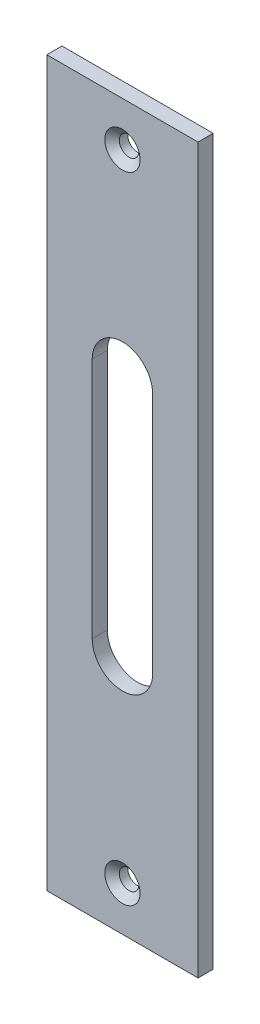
ISO-10303-21;
HEADER;
FILE_DESCRIPTION(('STEP AP214'),'2;1');
FILE_NAME('part.step','',(''),(''),'','','');
FILE_SCHEMA(('AUTOMOTIVE_DESIGN { 1 0 10303 214 1 1 1 1 }'));
ENDSEC;
DATA;
#1=APPLICATION_CONTEXT('core data for automotive mechanical design processes');
#2=APPLICATION_PROTOCOL_DEFINITION('international standard','automotive_design',2000,#1);
#3=PRODUCT_CONTEXT('',#1,'mechanical');
#4=PRODUCT('Part','Part','',(#3));
#5=PRODUCT_RELATED_PRODUCT_CATEGORY('part','',(#4));
#6=PRODUCT_DEFINITION_FORMATION('','',#4);
#7=PRODUCT_DEFINITION_CONTEXT('part definition',#1,'design');
#8=PRODUCT_DEFINITION('design','',#6,#7);
#9=PRODUCT_DEFINITION_SHAPE('','',#8);
#10=(LENGTH_UNIT() NAMED_UNIT(*) SI_UNIT(.MILLI.,.METRE.));
#11=(NAMED_UNIT(*) PLANE_ANGLE_UNIT() SI_UNIT($,.RADIAN.));
#12=(NAMED_UNIT(*) SI_UNIT($,.STERADIAN.) SOLID_ANGLE_UNIT());
#13=UNCERTAINTY_MEASURE_WITH_UNIT(LENGTH_MEASURE(1.E-05),#10,'distance_accuracy_value','');
#14=(GEOMETRIC_REPRESENTATION_CONTEXT(3) GLOBAL_UNCERTAINTY_ASSIGNED_CONTEXT((#13)) GLOBAL_UNIT_ASSIGNED_CONTEXT((#10,
#11,#12)) REPRESENTATION_CONTEXT('',''));
#15=CARTESIAN_POINT('',(0.,0.,0.));
#16=DIRECTION('',(0.,0.,1.));
#17=DIRECTION('',(1.,0.,0.));
#18=AXIS2_PLACEMENT_3D('',#15,#16,#17);
#19=CARTESIAN_POINT('',(-7.9375,-38.,1.5875));
#20=DIRECTION('',(1.,0.,0.));
#21=DIRECTION('',(0.,0.,-1.));
#22=AXIS2_PLACEMENT_3D('',#19,#20,#21);
#23=PLANE('',#22);
#24=DIRECTION('',(0.,-1.,0.));
#25=VECTOR('',#24,1.);
#26=CARTESIAN_POINT('',(-7.9375,-38.,0.));
#27=LINE('',#26,#25);
#28=CARTESIAN_POINT('',(-7.9375,38.,0.));
#29=VERTEX_POINT('',#28);
#30=CARTESIAN_POINT('',(-7.9375,-38.,0.));
#31=VERTEX_POINT('',#30);
#32=EDGE_CURVE('E133',#29,#31,#27,.T.);
#33=ORIENTED_EDGE('',*,*,#32,.T.);
#34=DIRECTION('',(0.,0.,-1.));
#35=VECTOR('',#34,1.);
#36=CARTESIAN_POINT('',(-7.9375,-38.,1.5875));
#37=LINE('',#36,#35);
#38=CARTESIAN_POINT('',(-7.9375,-38.,1.5875));
#39=VERTEX_POINT('',#38);
#40=EDGE_CURVE('E11',#39,#31,#37,.T.);
#41=ORIENTED_EDGE('',*,*,#40,.F.);
#42=DIRECTION('',(0.,-1.,0.));
#43=VECTOR('',#42,1.);
#44=CARTESIAN_POINT('',(-7.9375,-38.,1.5875));
#45=LINE('',#44,#43);
#46=CARTESIAN_POINT('',(-7.9375,38.,1.5875));
#47=VERTEX_POINT('',#46);
#48=EDGE_CURVE('E144',#47,#39,#45,.T.);
#49=ORIENTED_EDGE('',*,*,#48,.F.);
#50=DIRECTION('',(0.,0.,-1.));
#51=VECTOR('',#50,1.);
#52=CARTESIAN_POINT('',(-7.9375,38.,1.5875));
#53=LINE('',#52,#51);
#54=EDGE_CURVE('E153',#47,#29,#53,.T.);
#55=ORIENTED_EDGE('',*,*,#54,.T.);
#56=EDGE_LOOP('',(#33,#41,#49,#55));
#57=FACE_BOUND('',#56,.T.);
#58=ADVANCED_FACE('F33',(#57),#23,.F.);
#59=CARTESIAN_POINT('',(-7.9375,-38.,1.5875));
#60=DIRECTION('',(0.,1.,0.));
#61=DIRECTION('',(0.,0.,1.));
#62=AXIS2_PLACEMENT_3D('',#59,#60,#61);
#63=PLANE('',#62);
#64=DIRECTION('',(1.,0.,0.));
#65=VECTOR('',#64,1.);
#66=CARTESIAN_POINT('',(-7.9375,-38.,0.));
#67=LINE('',#66,#65);
#68=CARTESIAN_POINT('',(7.93749999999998,-38.,0.));
#69=VERTEX_POINT('',#68);
#70=EDGE_CURVE('E138',#31,#69,#67,.T.);
#71=ORIENTED_EDGE('',*,*,#70,.T.);
#72=DIRECTION('',(0.,0.,-1.));
#73=VECTOR('',#72,1.);
#74=CARTESIAN_POINT('',(7.93749999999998,-38.,1.5875));
#75=LINE('',#74,#73);
#76=CARTESIAN_POINT('',(7.93749999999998,-38.,1.5875));
#77=VERTEX_POINT('',#76);
#78=EDGE_CURVE('E41',#77,#69,#75,.T.);
#79=ORIENTED_EDGE('',*,*,#78,.F.);
#80=DIRECTION('',(1.,0.,0.));
#81=VECTOR('',#80,1.);
#82=CARTESIAN_POINT('',(-7.9375,-38.,1.5875));
#83=LINE('',#82,#81);
#84=EDGE_CURVE('E147',#39,#77,#83,.T.);
#85=ORIENTED_EDGE('',*,*,#84,.F.);
#86=ORIENTED_EDGE('',*,*,#40,.T.);
#87=EDGE_LOOP('',(#71,#79,#85,#86));
#88=FACE_BOUND('',#87,.T.);
#89=ADVANCED_FACE('F205',(#88),#63,.F.);
#90=CARTESIAN_POINT('',(7.93749999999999,38.,1.5875));
#91=DIRECTION('',(-1.,0.,0.));
#92=DIRECTION('',(0.,-1.,0.));
#93=AXIS2_PLACEMENT_3D('',#90,#91,#92);
#94=PLANE('',#93);
#95=DIRECTION('',(0.,1.,0.));
#96=VECTOR('',#95,1.);
#97=CARTESIAN_POINT('',(7.93749999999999,38.,0.));
#98=LINE('',#97,#96);
#99=CARTESIAN_POINT('',(7.93749999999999,38.,0.));
#100=VERTEX_POINT('',#99);
#101=EDGE_CURVE('E140',#69,#100,#98,.T.);
#102=ORIENTED_EDGE('',*,*,#101,.T.);
#103=DIRECTION('',(0.,0.,-1.));
#104=VECTOR('',#103,1.);
#105=CARTESIAN_POINT('',(7.93749999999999,38.,1.5875));
#106=LINE('',#105,#104);
#107=CARTESIAN_POINT('',(7.93749999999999,38.,1.5875));
#108=VERTEX_POINT('',#107);
#109=EDGE_CURVE('E156',#108,#100,#106,.T.);
#110=ORIENTED_EDGE('',*,*,#109,.F.);
#111=DIRECTION('',(0.,1.,0.));
#112=VECTOR('',#111,1.);
#113=CARTESIAN_POINT('',(7.93749999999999,38.,1.5875));
#114=LINE('',#113,#112);
#115=EDGE_CURVE('E149',#77,#108,#114,.T.);
#116=ORIENTED_EDGE('',*,*,#115,.F.);
#117=ORIENTED_EDGE('',*,*,#78,.T.);
#118=EDGE_LOOP('',(#102,#110,#116,#117));
#119=FACE_BOUND('',#118,.T.);
#120=ADVANCED_FACE('F201',(#119),#94,.F.);
#121=CARTESIAN_POINT('',(7.93749999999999,38.,1.5875));
#122=DIRECTION('',(0.,-1.,0.));
#123=DIRECTION('',(0.,0.,-1.));
#124=AXIS2_PLACEMENT_3D('',#121,#122,#123);
#125=PLANE('',#124);
#126=DIRECTION('',(-1.,0.,0.));
#127=VECTOR('',#126,1.);
#128=CARTESIAN_POINT('',(7.93749999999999,38.,0.));
#129=LINE('',#128,#127);
#130=EDGE_CURVE('E142',#100,#29,#129,.T.);
#131=ORIENTED_EDGE('',*,*,#130,.T.);
#132=ORIENTED_EDGE('',*,*,#54,.F.);
#133=DIRECTION('',(-1.,0.,0.));
#134=VECTOR('',#133,1.);
#135=CARTESIAN_POINT('',(7.93749999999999,38.,1.5875));
#136=LINE('',#135,#134);
#137=EDGE_CURVE('E151',#108,#47,#136,.T.);
#138=ORIENTED_EDGE('',*,*,#137,.F.);
#139=ORIENTED_EDGE('',*,*,#109,.T.);
#140=EDGE_LOOP('',(#131,#132,#138,#139));
#141=FACE_BOUND('',#140,.T.);
#142=ADVANCED_FACE('F192',(#141),#125,.F.);
#143=CARTESIAN_POINT('',(-7.9375,38.,1.5875));
#144=DIRECTION('',(0.,0.,1.));
#145=DIRECTION('',(1.,0.,0.));
#146=AXIS2_PLACEMENT_3D('',#143,#144,#145);
#147=PLANE('',#146);
#148=CARTESIAN_POINT('',(0.,33.3375,1.5875));
#149=DIRECTION('',(0.,0.,1.));
#150=DIRECTION('',(1.,0.,0.));
#151=AXIS2_PLACEMENT_3D('',#148,#149,#150);
#152=CIRCLE('',#151,1.8542);
#153=CARTESIAN_POINT('',(1.85420000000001,33.3375,1.5875));
#154=VERTEX_POINT('',#153);
#155=EDGE_CURVE('E173',#154,#154,#152,.T.);
#156=ORIENTED_EDGE('',*,*,#155,.F.);
#157=EDGE_LOOP('',(#156));
#158=FACE_BOUND('',#157,.T.);
#159=CARTESIAN_POINT('',(0.,-33.3375,1.5875));
#160=DIRECTION('',(0.,0.,1.));
#161=DIRECTION('',(1.,0.,0.));
#162=AXIS2_PLACEMENT_3D('',#159,#160,#161);
#163=CIRCLE('',#162,1.8542);
#164=CARTESIAN_POINT('',(1.8542,-33.3375,1.5875));
#165=VERTEX_POINT('',#164);
#166=EDGE_CURVE('E162',#165,#165,#163,.T.);
#167=ORIENTED_EDGE('',*,*,#166,.F.);
#168=EDGE_LOOP('',(#167));
#169=FACE_BOUND('',#168,.T.);
#170=CARTESIAN_POINT('',(0.,12.7,1.5875));
#171=DIRECTION('',(0.,0.,1.));
#172=DIRECTION('',(-1.,0.,0.));
#173=AXIS2_PLACEMENT_3D('',#170,#171,#172);
#174=CIRCLE('',#173,3.175);
#175=CARTESIAN_POINT('',(3.175,12.7,1.5875));
#176=VERTEX_POINT('',#175);
#177=CARTESIAN_POINT('',(-3.175,12.7,1.5875));
#178=VERTEX_POINT('',#177);
#179=EDGE_CURVE('E49',#176,#178,#174,.T.);
#180=ORIENTED_EDGE('',*,*,#179,.F.);
#181=DIRECTION('',(0.,1.,0.));
#182=VECTOR('',#181,1.);
#183=CARTESIAN_POINT('',(3.175,-12.7,1.5875));
#184=LINE('',#183,#182);
#185=CARTESIAN_POINT('',(3.175,-12.7,1.5875));
#186=VERTEX_POINT('',#185);
#187=EDGE_CURVE('E117',#186,#176,#184,.T.);
#188=ORIENTED_EDGE('',*,*,#187,.F.);
#189=CARTESIAN_POINT('',(0.,-12.7,1.5875));
#190=DIRECTION('',(0.,0.,1.));
#191=DIRECTION('',(1.,0.,0.));
#192=AXIS2_PLACEMENT_3D('',#189,#190,#191);
#193=CIRCLE('',#192,3.175);
#194=CARTESIAN_POINT('',(-3.175,-12.7,1.5875));
#195=VERTEX_POINT('',#194);
#196=EDGE_CURVE('E101',#195,#186,#193,.T.);
#197=ORIENTED_EDGE('',*,*,#196,.F.);
#198=DIRECTION('',(0.,-1.,0.));
#199=VECTOR('',#198,1.);
#200=CARTESIAN_POINT('',(-3.175,-12.7,1.5875));
#201=LINE('',#200,#199);
#202=EDGE_CURVE('E110',#178,#195,#201,.T.);
#203=ORIENTED_EDGE('',*,*,#202,.F.);
#204=EDGE_LOOP('',(#180,#188,#197,#203));
#205=FACE_BOUND('',#204,.T.);
#206=ORIENTED_EDGE('',*,*,#48,.T.);
#207=ORIENTED_EDGE('',*,*,#84,.T.);
#208=ORIENTED_EDGE('',*,*,#115,.T.);
#209=ORIENTED_EDGE('',*,*,#137,.T.);
#210=EDGE_LOOP('',(#206,#207,#208,#209));
#211=FACE_BOUND('',#210,.T.);
#212=ADVANCED_FACE('F114',(#158,#169,#205,#211),#147,.T.);
#213=CARTESIAN_POINT('',(-7.9375,38.,0.));
#214=DIRECTION('',(0.,0.,1.));
#215=DIRECTION('',(1.,0.,0.));
#216=AXIS2_PLACEMENT_3D('',#213,#214,#215);
#217=PLANE('',#216);
#218=CARTESIAN_POINT('',(0.,33.3375,0.));
#219=DIRECTION('',(0.,0.,1.));
#220=DIRECTION('',(1.,0.,0.));
#221=AXIS2_PLACEMENT_3D('',#218,#219,#220);
#222=CIRCLE('',#221,1.02869999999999);
#223=CARTESIAN_POINT('',(1.0287,33.3375,0.));
#224=VERTEX_POINT('',#223);
#225=EDGE_CURVE('E36',#224,#224,#222,.T.);
#226=ORIENTED_EDGE('',*,*,#225,.T.);
#227=EDGE_LOOP('',(#226));
#228=FACE_BOUND('',#227,.T.);
#229=CARTESIAN_POINT('',(0.,-33.3375,0.));
#230=DIRECTION('',(0.,0.,1.));
#231=DIRECTION('',(1.,0.,0.));
#232=AXIS2_PLACEMENT_3D('',#229,#230,#231);
#233=CIRCLE('',#232,1.02869999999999);
#234=CARTESIAN_POINT('',(1.02869999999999,-33.3375,0.));
#235=VERTEX_POINT('',#234);
#236=EDGE_CURVE('E160',#235,#235,#233,.T.);
#237=ORIENTED_EDGE('',*,*,#236,.T.);
#238=EDGE_LOOP('',(#237));
#239=FACE_BOUND('',#238,.T.);
#240=DIRECTION('',(0.,1.,0.));
#241=VECTOR('',#240,1.);
#242=CARTESIAN_POINT('',(3.175,-12.7,0.));
#243=LINE('',#242,#241);
#244=CARTESIAN_POINT('',(3.175,-12.7,0.));
#245=VERTEX_POINT('',#244);
#246=CARTESIAN_POINT('',(3.175,12.7,0.));
#247=VERTEX_POINT('',#246);
#248=EDGE_CURVE('E128',#245,#247,#243,.T.);
#249=ORIENTED_EDGE('',*,*,#248,.T.);
#250=CARTESIAN_POINT('',(0.,12.7,0.));
#251=DIRECTION('',(0.,0.,1.));
#252=DIRECTION('',(-1.,0.,0.));
#253=AXIS2_PLACEMENT_3D('',#250,#251,#252);
#254=CIRCLE('',#253,3.175);
#255=CARTESIAN_POINT('',(-3.175,12.7,0.));
#256=VERTEX_POINT('',#255);
#257=EDGE_CURVE('E119',#247,#256,#254,.T.);
#258=ORIENTED_EDGE('',*,*,#257,.T.);
#259=DIRECTION('',(0.,-1.,0.));
#260=VECTOR('',#259,1.);
#261=CARTESIAN_POINT('',(-3.175,-12.7,0.));
#262=LINE('',#261,#260);
#263=CARTESIAN_POINT('',(-3.175,-12.7,0.));
#264=VERTEX_POINT('',#263);
#265=EDGE_CURVE('E125',#256,#264,#262,.T.);
#266=ORIENTED_EDGE('',*,*,#265,.T.);
#267=CARTESIAN_POINT('',(0.,-12.7,0.));
#268=DIRECTION('',(0.,0.,1.));
#269=DIRECTION('',(1.,0.,0.));
#270=AXIS2_PLACEMENT_3D('',#267,#268,#269);
#271=CIRCLE('',#270,3.175);
#272=EDGE_CURVE('E57',#264,#245,#271,.T.);
#273=ORIENTED_EDGE('',*,*,#272,.T.);
#274=EDGE_LOOP('',(#249,#258,#266,#273));
#275=FACE_BOUND('',#274,.T.);
#276=ORIENTED_EDGE('',*,*,#32,.F.);
#277=ORIENTED_EDGE('',*,*,#130,.F.);
#278=ORIENTED_EDGE('',*,*,#101,.F.);
#279=ORIENTED_EDGE('',*,*,#70,.F.);
#280=EDGE_LOOP('',(#276,#277,#278,#279));
#281=FACE_BOUND('',#280,.T.);
#282=ADVANCED_FACE('F191',(#228,#239,#275,#281),#217,.F.);
#283=CARTESIAN_POINT('',(0.,12.7,0.));
#284=DIRECTION('',(0.,0.,1.));
#285=DIRECTION('',(1.,0.,0.));
#286=AXIS2_PLACEMENT_3D('',#283,#284,#285);
#287=CYLINDRICAL_SURFACE('',#286,3.175);
#288=ORIENTED_EDGE('',*,*,#179,.T.);
#289=DIRECTION('',(0.,0.,1.));
#290=VECTOR('',#289,1.);
#291=CARTESIAN_POINT('',(-3.175,12.7,0.));
#292=LINE('',#291,#290);
#293=EDGE_CURVE('E107',#256,#178,#292,.T.);
#294=ORIENTED_EDGE('',*,*,#293,.F.);
#295=ORIENTED_EDGE('',*,*,#257,.F.);
#296=DIRECTION('',(0.,0.,1.));
#297=VECTOR('',#296,1.);
#298=CARTESIAN_POINT('',(3.175,12.7,0.));
#299=LINE('',#298,#297);
#300=EDGE_CURVE('E131',#247,#176,#299,.T.);
#301=ORIENTED_EDGE('',*,*,#300,.T.);
#302=EDGE_LOOP('',(#288,#294,#295,#301));
#303=FACE_BOUND('',#302,.T.);
#304=ADVANCED_FACE('F198',(#303),#287,.F.);
#305=CARTESIAN_POINT('',(3.175,-12.7,0.));
#306=DIRECTION('',(1.,0.,0.));
#307=DIRECTION('',(0.,1.,0.));
#308=AXIS2_PLACEMENT_3D('',#305,#306,#307);
#309=PLANE('',#308);
#310=ORIENTED_EDGE('',*,*,#187,.T.);
#311=ORIENTED_EDGE('',*,*,#300,.F.);
#312=ORIENTED_EDGE('',*,*,#248,.F.);
#313=DIRECTION('',(0.,0.,1.));
#314=VECTOR('',#313,1.);
#315=CARTESIAN_POINT('',(3.175,-12.7,0.));
#316=LINE('',#315,#314);
#317=EDGE_CURVE('E106',#245,#186,#316,.T.);
#318=ORIENTED_EDGE('',*,*,#317,.T.);
#319=EDGE_LOOP('',(#310,#311,#312,#318));
#320=FACE_BOUND('',#319,.T.);
#321=ADVANCED_FACE('F243',(#320),#309,.F.);
#322=CARTESIAN_POINT('',(0.,-12.7,0.));
#323=DIRECTION('',(0.,0.,1.));
#324=DIRECTION('',(1.,0.,0.));
#325=AXIS2_PLACEMENT_3D('',#322,#323,#324);
#326=CYLINDRICAL_SURFACE('',#325,3.175);
#327=ORIENTED_EDGE('',*,*,#196,.T.);
#328=ORIENTED_EDGE('',*,*,#317,.F.);
#329=ORIENTED_EDGE('',*,*,#272,.F.);
#330=DIRECTION('',(0.,0.,1.));
#331=VECTOR('',#330,1.);
#332=CARTESIAN_POINT('',(-3.175,-12.7,0.));
#333=LINE('',#332,#331);
#334=EDGE_CURVE('E97',#264,#195,#333,.T.);
#335=ORIENTED_EDGE('',*,*,#334,.T.);
#336=EDGE_LOOP('',(#327,#328,#329,#335));
#337=FACE_BOUND('',#336,.T.);
#338=ADVANCED_FACE('F99',(#337),#326,.F.);
#339=CARTESIAN_POINT('',(-3.175,-12.7,0.));
#340=DIRECTION('',(-1.,0.,0.));
#341=DIRECTION('',(0.,-1.,0.));
#342=AXIS2_PLACEMENT_3D('',#339,#340,#341);
#343=PLANE('',#342);
#344=ORIENTED_EDGE('',*,*,#202,.T.);
#345=ORIENTED_EDGE('',*,*,#334,.F.);
#346=ORIENTED_EDGE('',*,*,#265,.F.);
#347=ORIENTED_EDGE('',*,*,#293,.T.);
#348=EDGE_LOOP('',(#344,#345,#346,#347));
#349=FACE_BOUND('',#348,.T.);
#350=ADVANCED_FACE('F111',(#349),#343,.F.);
#351=CARTESIAN_POINT('',(0.,-33.3375,1.5875));
#352=DIRECTION('',(0.,0.,1.));
#353=DIRECTION('',(1.,0.,0.));
#354=AXIS2_PLACEMENT_3D('',#351,#352,#353);
#355=CYLINDRICAL_SURFACE('',#354,1.02869999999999);
#356=CARTESIAN_POINT('',(0.,-33.3375,0.894823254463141));
#357=DIRECTION('',(0.,0.,1.));
#358=DIRECTION('',(1.,0.,0.));
#359=AXIS2_PLACEMENT_3D('',#356,#357,#358);
#360=CIRCLE('',#359,1.02869999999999);
#361=CARTESIAN_POINT('',(1.02869999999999,-33.3375,0.894823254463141));
#362=VERTEX_POINT('',#361);
#363=EDGE_CURVE('E166',#362,#362,#360,.T.);
#364=ORIENTED_EDGE('',*,*,#363,.T.);
#365=EDGE_LOOP('',(#364));
#366=FACE_BOUND('',#365,.T.);
#367=ORIENTED_EDGE('',*,*,#236,.F.);
#368=EDGE_LOOP('',(#367));
#369=FACE_BOUND('',#368,.T.);
#370=ADVANCED_FACE('F269',(#366,#369),#355,.F.);
#371=CARTESIAN_POINT('',(0.,-33.3375,1.5875));
#372=DIRECTION('',(0.,0.,1.));
#373=DIRECTION('',(1.,0.,0.));
#374=AXIS2_PLACEMENT_3D('',#371,#372,#373);
#375=CONICAL_SURFACE('',#374,1.8542,0.87266462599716);
#376=ORIENTED_EDGE('',*,*,#363,.F.);
#377=EDGE_LOOP('',(#376));
#378=FACE_BOUND('',#377,.T.);
#379=ORIENTED_EDGE('',*,*,#166,.T.);
#380=EDGE_LOOP('',(#379));
#381=FACE_BOUND('',#380,.T.);
#382=ADVANCED_FACE('F287',(#378,#381),#375,.F.);
#383=CARTESIAN_POINT('',(0.,33.3375,1.5875));
#384=DIRECTION('',(0.,0.,1.));
#385=DIRECTION('',(1.,0.,0.));
#386=AXIS2_PLACEMENT_3D('',#383,#384,#385);
#387=CYLINDRICAL_SURFACE('',#386,1.02869999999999);
#388=CARTESIAN_POINT('',(0.,33.3375,0.894823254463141));
#389=DIRECTION('',(0.,0.,1.));
#390=DIRECTION('',(1.,0.,0.));
#391=AXIS2_PLACEMENT_3D('',#388,#389,#390);
#392=CIRCLE('',#391,1.02869999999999);
#393=CARTESIAN_POINT('',(1.0287,33.3375,0.894823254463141));
#394=VERTEX_POINT('',#393);
#395=EDGE_CURVE('E176',#394,#394,#392,.T.);
#396=ORIENTED_EDGE('',*,*,#395,.T.);
#397=EDGE_LOOP('',(#396));
#398=FACE_BOUND('',#397,.T.);
#399=ORIENTED_EDGE('',*,*,#225,.F.);
#400=EDGE_LOOP('',(#399));
#401=FACE_BOUND('',#400,.T.);
#402=ADVANCED_FACE('F180',(#398,#401),#387,.F.);
#403=CARTESIAN_POINT('',(0.,33.3375,1.5875));
#404=DIRECTION('',(0.,0.,1.));
#405=DIRECTION('',(1.,0.,0.));
#406=AXIS2_PLACEMENT_3D('',#403,#404,#405);
#407=CONICAL_SURFACE('',#406,1.8542,0.87266462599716);
#408=ORIENTED_EDGE('',*,*,#395,.F.);
#409=EDGE_LOOP('',(#408));
#410=FACE_BOUND('',#409,.T.);
#411=ORIENTED_EDGE('',*,*,#155,.T.);
#412=EDGE_LOOP('',(#411));
#413=FACE_BOUND('',#412,.T.);
#414=ADVANCED_FACE('F183',(#410,#413),#407,.F.);
#415=CLOSED_SHELL('',(#58,#89,#120,#142,#212,#282,#304,#321,#338,#350,#370,#382,#402,#414));
#416=MANIFOLD_SOLID_BREP('B2',#415);
#417=ADVANCED_BREP_SHAPE_REPRESENTATION('',(#18,#416),#14);
#418=SHAPE_DEFINITION_REPRESENTATION(#9,#417);
ENDSEC;
END-ISO-10303-21;
